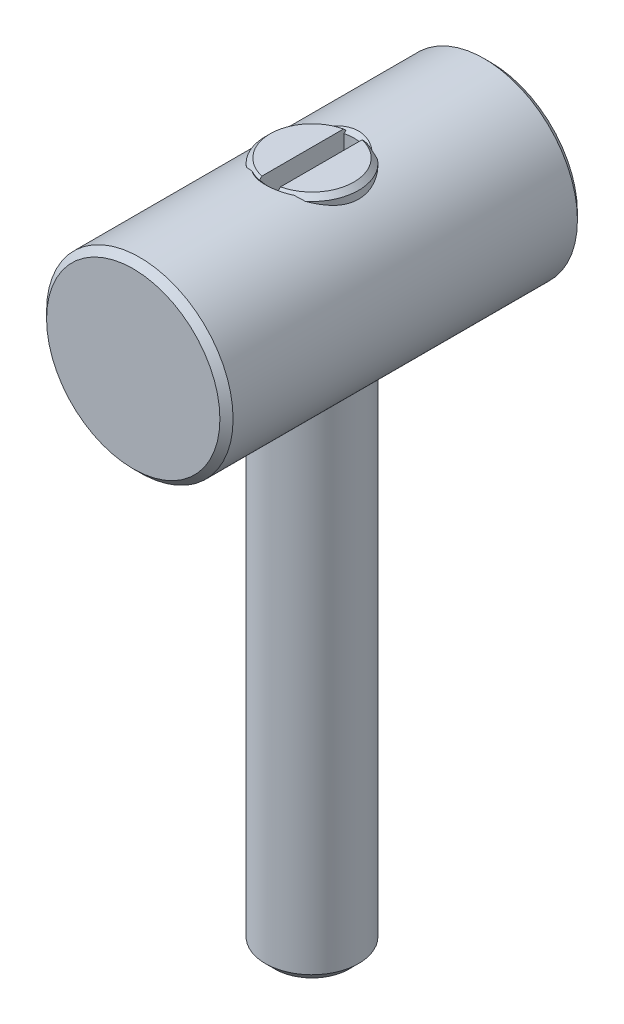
ISO-10303-21;
HEADER;
FILE_DESCRIPTION(('STEP AP214'),'2;1');
FILE_NAME('part.step','',(''),(''),'','','');
FILE_SCHEMA(('AUTOMOTIVE_DESIGN { 1 0 10303 214 1 1 1 1 }'));
ENDSEC;
DATA;
#1=APPLICATION_CONTEXT('core data for automotive mechanical design processes');
#2=APPLICATION_PROTOCOL_DEFINITION('international standard','automotive_design',2000,#1);
#3=PRODUCT_CONTEXT('',#1,'mechanical');
#4=PRODUCT('Part','Part','',(#3));
#5=PRODUCT_RELATED_PRODUCT_CATEGORY('part','',(#4));
#6=PRODUCT_DEFINITION_FORMATION('','',#4);
#7=PRODUCT_DEFINITION_CONTEXT('part definition',#1,'design');
#8=PRODUCT_DEFINITION('design','',#6,#7);
#9=PRODUCT_DEFINITION_SHAPE('','',#8);
#10=(LENGTH_UNIT() NAMED_UNIT(*) SI_UNIT(.MILLI.,.METRE.));
#11=(NAMED_UNIT(*) PLANE_ANGLE_UNIT() SI_UNIT($,.RADIAN.));
#12=(NAMED_UNIT(*) SI_UNIT($,.STERADIAN.) SOLID_ANGLE_UNIT());
#13=UNCERTAINTY_MEASURE_WITH_UNIT(LENGTH_MEASURE(1.E-05),#10,'distance_accuracy_value','');
#14=(GEOMETRIC_REPRESENTATION_CONTEXT(3) GLOBAL_UNCERTAINTY_ASSIGNED_CONTEXT((#13)) GLOBAL_UNIT_ASSIGNED_CONTEXT((#10,
#11,#12)) REPRESENTATION_CONTEXT('',''));
#15=CARTESIAN_POINT('',(0.,0.,0.));
#16=DIRECTION('',(0.,0.,1.));
#17=DIRECTION('',(1.,0.,0.));
#18=AXIS2_PLACEMENT_3D('',#15,#16,#17);
#19=CARTESIAN_POINT('',(0.,-4.,0.));
#20=DIRECTION('',(0.,-1.,0.));
#21=DIRECTION('',(-1.,0.,0.));
#22=AXIS2_PLACEMENT_3D('',#19,#20,#21);
#23=CYLINDRICAL_SURFACE('',#22,1.5);
#24=CARTESIAN_POINT('',(0.947331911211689,2.8465,-1.16299709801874));
#25=CARTESIAN_POINT('',(1.01351143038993,2.82450537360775,-1.10908406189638));
#26=CARTESIAN_POINT('',(1.07489527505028,2.80147999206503,-1.04969000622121));
#27=CARTESIAN_POINT('',(1.18710041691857,2.75580128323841,-0.920938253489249));
#28=CARTESIAN_POINT('',(1.2378650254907,2.73315051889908,-0.851530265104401));
#29=CARTESIAN_POINT('',(1.32722551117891,2.69089876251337,-0.704204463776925));
#30=CARTESIAN_POINT('',(1.36579908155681,2.67130339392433,-0.626271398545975));
#31=CARTESIAN_POINT('',(1.42909401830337,2.63798775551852,-0.46394540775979));
#32=CARTESIAN_POINT('',(1.45385048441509,2.62425262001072,-0.379569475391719));
#33=CARTESIAN_POINT('',(1.48697739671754,2.60561664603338,-0.213368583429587));
#34=CARTESIAN_POINT('',(1.49644089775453,2.60012870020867,-0.131829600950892));
#35=CARTESIAN_POINT('',(1.5018928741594,2.59698536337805,0.0318566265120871));
#36=CARTESIAN_POINT('',(1.49788424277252,2.59932829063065,0.114003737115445));
#37=CARTESIAN_POINT('',(1.47773438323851,2.61082510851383,0.267779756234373));
#38=CARTESIAN_POINT('',(1.4628558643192,2.61926920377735,0.339634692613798));
#39=CARTESIAN_POINT('',(1.42308110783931,2.64108893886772,0.47973567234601));
#40=CARTESIAN_POINT('',(1.39818007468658,2.65446693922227,0.547979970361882));
#41=CARTESIAN_POINT('',(1.33746138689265,2.68559571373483,0.683395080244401));
#42=CARTESIAN_POINT('',(1.30108662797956,2.70355780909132,0.750265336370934));
#43=CARTESIAN_POINT('',(1.21901847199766,2.74153817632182,0.877331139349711));
#44=CARTESIAN_POINT('',(1.17332890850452,2.76155560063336,0.93752941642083));
#45=CARTESIAN_POINT('',(1.09644538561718,2.79260769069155,1.02443697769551));
#46=CARTESIAN_POINT('',(1.06820925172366,2.80355315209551,1.05384666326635));
#47=CARTESIAN_POINT('',(1.00945808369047,2.82523876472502,1.11024632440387));
#48=CARTESIAN_POINT('',(0.978947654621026,2.83597927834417,1.13724095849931));
#49=CARTESIAN_POINT('',(0.947331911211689,2.8465,1.16299709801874));
#50=B_SPLINE_CURVE_WITH_KNOTS('',3,(#24,#25,#26,#27,#28,#29,#30,#31,#32,#33,#34,#35,#36,#37,#38,
#39,#40,#41,#42,#43,#44,#45,#46,#47,#48,#49),.UNSPECIFIED.,.F.,.F.,(4,2,2,2,2,2,2,2,2,2,2,2,4),
(0.,0.264174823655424,0.529725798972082,0.79575989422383,1.06111506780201,1.30649824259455,
1.55182872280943,1.77244859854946,1.99317416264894,2.22691434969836,2.46055853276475,
2.58708455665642,2.71336100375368),.UNSPECIFIED.);
#51=CARTESIAN_POINT('',(0.947331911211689,2.8465,-1.16299709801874));
#52=VERTEX_POINT('',#51);
#53=CARTESIAN_POINT('',(0.947331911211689,2.8465,1.16299709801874));
#54=VERTEX_POINT('',#53);
#55=EDGE_CURVE('E221',#52,#54,#50,.T.);
#56=ORIENTED_EDGE('',*,*,#55,.F.);
#57=CARTESIAN_POINT('',(0.,2.8465,0.));
#58=DIRECTION('',(0.,-1.,0.));
#59=DIRECTION('',(-1.,0.,0.));
#60=AXIS2_PLACEMENT_3D('',#57,#58,#59);
#61=CIRCLE('',#60,1.5);
#62=EDGE_CURVE('E125',#52,#54,#61,.T.);
#63=ORIENTED_EDGE('',*,*,#62,.T.);
#64=EDGE_LOOP('',(#56,#63));
#65=FACE_BOUND('',#64,.T.);
#66=ADVANCED_FACE('F14',(#65),#23,.T.);
#67=CARTESIAN_POINT('',(0.,3.,0.));
#68=DIRECTION('',(0.,-1.,0.));
#69=DIRECTION('',(-1.,0.,0.));
#70=AXIS2_PLACEMENT_3D('',#67,#68,#69);
#71=PLANE('',#70);
#72=DIRECTION('',(0.,0.,1.));
#73=VECTOR('',#72,1.);
#74=CARTESIAN_POINT('',(-0.3,3.,0.));
#75=LINE('',#74,#73);
#76=CARTESIAN_POINT('',(-0.3,3.,-1.31265465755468));
#77=VERTEX_POINT('',#76);
#78=CARTESIAN_POINT('',(-0.3,3.,1.31265465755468));
#79=VERTEX_POINT('',#78);
#80=EDGE_CURVE('E110',#77,#79,#75,.T.);
#81=ORIENTED_EDGE('',*,*,#80,.F.);
#82=CARTESIAN_POINT('',(0.,3.,0.));
#83=DIRECTION('',(0.,-1.,0.));
#84=DIRECTION('',(-1.,0.,0.));
#85=AXIS2_PLACEMENT_3D('',#82,#83,#84);
#86=CIRCLE('',#85,1.3465);
#87=EDGE_CURVE('E121',#79,#77,#86,.T.);
#88=ORIENTED_EDGE('',*,*,#87,.F.);
#89=EDGE_LOOP('',(#81,#88));
#90=FACE_BOUND('',#89,.T.);
#91=ADVANCED_FACE('F120',(#90),#71,.F.);
#92=CARTESIAN_POINT('',(0.,3.,0.));
#93=DIRECTION('',(0.,-1.,0.));
#94=DIRECTION('',(-1.,0.,0.));
#95=AXIS2_PLACEMENT_3D('',#92,#93,#94);
#96=CONICAL_SURFACE('',#95,1.3465,0.785398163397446);
#97=CARTESIAN_POINT('',(-0.992835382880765,2.83095,-1.14506318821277));
#98=CARTESIAN_POINT('',(-0.929590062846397,2.85313590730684,-1.17057691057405));
#99=CARTESIAN_POINT('',(-0.864893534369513,2.87343844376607,-1.19430901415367));
#100=CARTESIAN_POINT('',(-0.733580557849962,2.90971649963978,-1.23716783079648));
#101=CARTESIAN_POINT('',(-0.666989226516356,2.92573258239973,-1.25633751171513));
#102=CARTESIAN_POINT('',(-0.531496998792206,2.95335159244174,-1.28959120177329));
#103=CARTESIAN_POINT('',(-0.46259234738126,2.96494692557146,-1.30366645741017));
#104=CARTESIAN_POINT('',(-0.322550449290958,2.98346059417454,-1.32622709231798));
#105=CARTESIAN_POINT('',(-0.251397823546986,2.99033132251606,-1.33465555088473));
#106=CARTESIAN_POINT('',(-0.1798,2.99460714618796,-1.33988292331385));
#107=B_SPLINE_CURVE_WITH_KNOTS('',3,(#97,#98,#99,#100,#101,#102,#103,#104,#105,#106),
.UNSPECIFIED.,.F.,.F.,(4,2,2,2,4),(0.,0.215180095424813,0.428245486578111,0.64167525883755,
0.85722531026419),.UNSPECIFIED.);
#108=CARTESIAN_POINT('',(-0.947331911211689,2.8465,-1.16299709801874));
#109=VERTEX_POINT('',#108);
#110=CARTESIAN_POINT('',(-0.674247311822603,2.92325,-1.25340780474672));
#111=VERTEX_POINT('',#110);
#112=EDGE_CURVE('E9',#109,#111,#107,.T.);
#113=ORIENTED_EDGE('',*,*,#112,.F.);
#114=CARTESIAN_POINT('',(-0.947331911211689,2.8465,1.16299709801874));
#115=VERTEX_POINT('',#114);
#116=EDGE_CURVE('E130',#115,#109,#61,.T.);
#117=ORIENTED_EDGE('',*,*,#116,.F.);
#118=CARTESIAN_POINT('',(-0.1798,2.99460714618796,1.33988292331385));
#119=CARTESIAN_POINT('',(-0.236038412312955,2.99124022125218,1.335761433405));
#120=CARTESIAN_POINT('',(-0.292017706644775,2.9862800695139,1.3296804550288));
#121=CARTESIAN_POINT('',(-0.403063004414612,2.97332250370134,1.31386344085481));
#122=CARTESIAN_POINT('',(-0.458129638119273,2.96532728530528,1.30413004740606));
#123=CARTESIAN_POINT('',(-0.56626748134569,2.94657689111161,1.28142693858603));
#124=CARTESIAN_POINT('',(-0.619355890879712,2.93586230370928,1.26850488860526));
#125=CARTESIAN_POINT('',(-0.724099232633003,2.91179776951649,1.23969917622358));
#126=CARTESIAN_POINT('',(-0.775754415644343,2.89844828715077,1.22381603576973));
#127=CARTESIAN_POINT('',(-0.854754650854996,2.87580466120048,1.1971455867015));
#128=CARTESIAN_POINT('',(-0.882653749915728,2.86736203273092,1.18725045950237));
#129=CARTESIAN_POINT('',(-0.93806639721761,2.8497157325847,1.16670181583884));
#130=CARTESIAN_POINT('',(-0.96557794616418,2.84050913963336,1.15604541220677));
#131=CARTESIAN_POINT('',(-0.992835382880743,2.83095,1.14506318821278));
#132=B_SPLINE_CURVE_WITH_KNOTS('',3,(#118,#119,#120,#121,#122,#123,#124,#125,#126,#127,#128,
#129,#130,#131),.UNSPECIFIED.,.F.,.F.,(4,2,2,2,2,2,4),(0.,0.169384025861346,0.338645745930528,
0.505516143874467,0.672357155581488,0.764685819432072,0.857385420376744),.UNSPECIFIED.);
#133=CARTESIAN_POINT('',(-0.674247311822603,2.92325,1.25340780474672));
#134=VERTEX_POINT('',#133);
#135=EDGE_CURVE('E40',#134,#115,#132,.T.);
#136=ORIENTED_EDGE('',*,*,#135,.F.);
#137=CARTESIAN_POINT('',(0.,2.92325,0.));
#138=DIRECTION('',(0.,1.,0.));
#139=DIRECTION('',(0.,0.,1.));
#140=AXIS2_PLACEMENT_3D('',#137,#138,#139);
#141=CIRCLE('',#140,1.42325);
#142=CARTESIAN_POINT('',(-0.3,2.92325,1.39127300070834));
#143=VERTEX_POINT('',#142);
#144=EDGE_CURVE('E189',#134,#143,#141,.T.);
#145=ORIENTED_EDGE('',*,*,#144,.T.);
#146=CARTESIAN_POINT('',(-0.3,2.8458,-1.4704082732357));
#147=CARTESIAN_POINT('',(-0.3,2.88115643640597,-1.43432199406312));
#148=CARTESIAN_POINT('',(-0.3,2.91648779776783,-1.39821111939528));
#149=CARTESIAN_POINT('',(-0.3,2.98714018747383,-1.32586601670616));
#150=CARTESIAN_POINT('',(-0.3,3.0224611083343,-1.28963168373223));
#151=CARTESIAN_POINT('',(-0.3,3.09397621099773,-1.21609681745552));
#152=CARTESIAN_POINT('',(-0.3,3.13016808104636,-1.1787940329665));
#153=CARTESIAN_POINT('',(-0.3,3.20237441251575,-1.10413383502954));
#154=CARTESIAN_POINT('',(-0.3,3.23838906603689,-1.06677660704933));
#155=CARTESIAN_POINT('',(-0.3,3.34146505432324,-0.959421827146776));
#156=CARTESIAN_POINT('',(-0.3,3.40833744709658,-0.889241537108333));
#157=CARTESIAN_POINT('',(-0.3,3.50808269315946,-0.78299989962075));
#158=CARTESIAN_POINT('',(-0.3,3.54134564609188,-0.747305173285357));
#159=CARTESIAN_POINT('',(-0.3,3.6074459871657,-0.675572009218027));
#160=CARTESIAN_POINT('',(-0.3,3.64028367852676,-0.639533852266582));
#161=CARTESIAN_POINT('',(-0.3,3.70448937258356,-0.567825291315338));
#162=CARTESIAN_POINT('',(-0.3,3.73587344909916,-0.53216929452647));
#163=CARTESIAN_POINT('',(-0.3,3.79773982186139,-0.459887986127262));
#164=CARTESIAN_POINT('',(-0.3,3.82821923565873,-0.423260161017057));
#165=CARTESIAN_POINT('',(-0.3,3.8723076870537,-0.367400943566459));
#166=CARTESIAN_POINT('',(-0.3,3.88664675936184,-0.348748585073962));
#167=CARTESIAN_POINT('',(-0.3,3.91462683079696,-0.310930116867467));
#168=CARTESIAN_POINT('',(-0.3,3.92826804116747,-0.291764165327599));
#169=CARTESIAN_POINT('',(-0.3,3.95444414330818,-0.252814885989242));
#170=CARTESIAN_POINT('',(-0.3,3.96698388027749,-0.233034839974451));
#171=CARTESIAN_POINT('',(-0.3,3.99041713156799,-0.192530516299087));
#172=CARTESIAN_POINT('',(-0.3,4.00131370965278,-0.171808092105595));
#173=CARTESIAN_POINT('',(-0.3,4.01290967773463,-0.145940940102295));
#174=CARTESIAN_POINT('',(-0.3,4.01488714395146,-0.141366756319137));
#175=CARTESIAN_POINT('',(-0.3,4.01870640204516,-0.132159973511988));
#176=CARTESIAN_POINT('',(-0.3,4.02054813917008,-0.127527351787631));
#177=CARTESIAN_POINT('',(-0.3,4.02584745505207,-0.113544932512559));
#178=CARTESIAN_POINT('',(-0.3,4.02908025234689,-0.104108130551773));
#179=CARTESIAN_POINT('',(-0.3,4.03477287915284,-0.08516895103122));
#180=CARTESIAN_POINT('',(-0.3,4.03724447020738,-0.0756701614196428));
#181=CARTESIAN_POINT('',(-0.3,4.04137161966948,-0.0564948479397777));
#182=CARTESIAN_POINT('',(-0.3,4.04302692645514,-0.0468182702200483));
#183=CARTESIAN_POINT('',(-0.3,4.04664228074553,-0.0172377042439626));
#184=CARTESIAN_POINT('',(-0.3,4.04714068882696,0.00287379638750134));
#185=CARTESIAN_POINT('',(-0.3,4.04412319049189,0.0428030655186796));
#186=CARTESIAN_POINT('',(-0.3,4.0405978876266,0.0626200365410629));
#187=CARTESIAN_POINT('',(-0.3,4.02858082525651,0.108260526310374));
#188=CARTESIAN_POINT('',(-0.3,4.01877038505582,0.133719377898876));
#189=CARTESIAN_POINT('',(-0.3,4.00150485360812,0.170708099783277));
#190=CARTESIAN_POINT('',(-0.3,3.9952966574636,0.182880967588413));
#191=CARTESIAN_POINT('',(-0.3,3.98222681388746,0.206871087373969));
#192=CARTESIAN_POINT('',(-0.3,3.97536538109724,0.218688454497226));
#193=CARTESIAN_POINT('',(-0.3,3.95218871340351,0.256757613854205));
#194=CARTESIAN_POINT('',(-0.3,3.93487575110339,0.282394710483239));
#195=CARTESIAN_POINT('',(-0.3,3.89886611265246,0.332686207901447));
#196=CARTESIAN_POINT('',(-0.3,3.8801680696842,0.357339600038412));
#197=CARTESIAN_POINT('',(-0.3,3.84187863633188,0.40604123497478));
#198=CARTESIAN_POINT('',(-0.3,3.82228508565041,0.430087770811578));
#199=CARTESIAN_POINT('',(-0.3,3.78254416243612,0.477720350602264));
#200=CARTESIAN_POINT('',(-0.3,3.76239671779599,0.501306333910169));
#201=CARTESIAN_POINT('',(-0.3,3.70125985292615,0.571740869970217));
#202=CARTESIAN_POINT('',(-0.3,3.65970988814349,0.618101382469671));
#203=CARTESIAN_POINT('',(-0.3,3.57590945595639,0.710039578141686));
#204=CARTESIAN_POINT('',(-0.3,3.53366022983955,0.75561840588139));
#205=CARTESIAN_POINT('',(-0.3,3.43788259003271,0.857897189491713));
#206=CARTESIAN_POINT('',(-0.3,3.38422190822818,0.914473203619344));
#207=CARTESIAN_POINT('',(-0.3,3.27645519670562,1.02726219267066));
#208=CARTESIAN_POINT('',(-0.3,3.22234892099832,1.08347493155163));
#209=CARTESIAN_POINT('',(-0.3,3.11457978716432,1.19491746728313));
#210=CARTESIAN_POINT('',(-0.3,3.06092031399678,1.25015053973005));
#211=CARTESIAN_POINT('',(-0.3,2.95345728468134,1.36040840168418));
#212=CARTESIAN_POINT('',(-0.3,2.8996538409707,1.41543330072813));
#213=CARTESIAN_POINT('',(-0.3,2.8458,1.4704082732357));
#214=B_SPLINE_CURVE_WITH_KNOTS('',3,(#146,#147,#148,#149,#150,#151,#152,#153,#154,#155,#156,
#157,#158,#159,#160,#161,#162,#163,#164,#165,#166,#167,#168,#169,#170,#171,#172,#173,#174,#175,
#176,#177,#178,#179,#180,#181,#182,#183,#184,#185,#186,#187,#188,#189,#190,#191,#192,#193,#194,
#195,#196,#197,#198,#199,#200,#201,#202,#203,#204,#205,#206,#207,#208,#209,#210,#211,#212,#213),
.UNSPECIFIED.,.F.,.F.,(4,2,2,2,2,2,2,2,2,2,2,2,2,2,2,2,2,2,2,2,2,2,2,2,2,2,2,2,2,2,2,2,2,4),(0.,
0.151560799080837,0.303364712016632,0.459287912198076,0.61495934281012,0.905769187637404,
1.05213984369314,1.19839964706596,1.34089509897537,1.48380422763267,1.5543752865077,
1.62492485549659,1.6951466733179,1.76523589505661,1.78018397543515,1.79513805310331,
1.82503814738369,1.85444992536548,1.88387076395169,1.94377833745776,2.00382609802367,
2.08518752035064,2.12617578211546,2.16715062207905,2.25986253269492,2.35266718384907,
2.44570893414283,2.53876285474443,2.72550711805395,2.91194943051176,3.14587396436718,
3.37993768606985,3.6109572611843,3.84183089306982),.UNSPECIFIED.);
#215=EDGE_CURVE('E117',#79,#143,#214,.T.);
#216=ORIENTED_EDGE('',*,*,#215,.F.);
#217=ORIENTED_EDGE('',*,*,#87,.T.);
#218=CARTESIAN_POINT('',(-0.3,2.92325,-1.39127300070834));
#219=VERTEX_POINT('',#218);
#220=EDGE_CURVE('E106',#219,#77,#214,.T.);
#221=ORIENTED_EDGE('',*,*,#220,.F.);
#222=CARTESIAN_POINT('',(0.,2.92325,0.));
#223=DIRECTION('',(0.,1.,0.));
#224=DIRECTION('',(0.,0.,1.));
#225=AXIS2_PLACEMENT_3D('',#222,#223,#224);
#226=CIRCLE('',#225,1.42325);
#227=EDGE_CURVE('E28',#219,#111,#226,.T.);
#228=ORIENTED_EDGE('',*,*,#227,.T.);
#229=EDGE_LOOP('',(#113,#117,#136,#145,#216,#217,#221,#228));
#230=FACE_BOUND('',#229,.T.);
#231=ADVANCED_FACE('F123',(#230),#96,.T.);
#232=CARTESIAN_POINT('',(0.3,33.3,0.));
#233=DIRECTION('',(-1.,0.,0.));
#234=DIRECTION('',(0.,0.,1.));
#235=AXIS2_PLACEMENT_3D('',#232,#233,#234);
#236=CYLINDRICAL_SURFACE('',#235,31.5);
#237=CARTESIAN_POINT('',(0.3,1.82813733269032,1.33111241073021));
#238=CARTESIAN_POINT('',(0.262266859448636,1.8284977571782,1.33962103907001));
#239=CARTESIAN_POINT('',(0.224170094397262,1.82879235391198,1.34651682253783));
#240=CARTESIAN_POINT('',(0.14752354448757,1.82924457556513,1.35705208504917));
#241=CARTESIAN_POINT('',(0.108973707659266,1.82940218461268,1.36069118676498));
#242=CARTESIAN_POINT('',(0.0324105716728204,1.82957344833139,1.36464401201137));
#243=CARTESIAN_POINT('',(-0.00559964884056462,1.82958968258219,1.3650173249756));
#244=CARTESIAN_POINT('',(-0.0815076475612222,1.82948446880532,1.36259212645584));
#245=CARTESIAN_POINT('',(-0.119405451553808,1.82936305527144,1.35979440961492));
#246=CARTESIAN_POINT('',(-0.205128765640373,1.82893560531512,1.34986012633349));
#247=CARTESIAN_POINT('',(-0.252842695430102,1.8285882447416,1.34174825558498));
#248=CARTESIAN_POINT('',(-0.3,1.82813733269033,1.33111241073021));
#249=B_SPLINE_CURVE_WITH_KNOTS('',3,(#237,#238,#239,#240,#241,#242,#243,#244,#245,#246,#247,
#248),.UNSPECIFIED.,.F.,.F.,(4,2,2,2,2,4),(0.,0.116010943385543,0.232035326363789,
0.345938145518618,0.459812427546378,0.604746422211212),.UNSPECIFIED.);
#250=CARTESIAN_POINT('',(0.3,1.82813733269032,1.33111241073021));
#251=VERTEX_POINT('',#250);
#252=CARTESIAN_POINT('',(-0.3,1.82813733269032,1.33111241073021));
#253=VERTEX_POINT('',#252);
#254=EDGE_CURVE('E293',#251,#253,#249,.T.);
#255=ORIENTED_EDGE('',*,*,#254,.F.);
#256=CARTESIAN_POINT('',(0.3,33.3,0.));
#257=DIRECTION('',(1.,0.,0.));
#258=DIRECTION('',(0.,0.,-1.));
#259=AXIS2_PLACEMENT_3D('',#256,#257,#258);
#260=CIRCLE('',#259,31.5);
#261=CARTESIAN_POINT('',(0.3,1.82813733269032,-1.33111241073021));
#262=VERTEX_POINT('',#261);
#263=EDGE_CURVE('E115',#251,#262,#260,.T.);
#264=ORIENTED_EDGE('',*,*,#263,.T.);
#265=CARTESIAN_POINT('',(-0.3,1.82813733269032,-1.33111241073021));
#266=CARTESIAN_POINT('',(-0.262266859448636,1.8284977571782,-1.33962103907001));
#267=CARTESIAN_POINT('',(-0.224170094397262,1.82879235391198,-1.34651682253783));
#268=CARTESIAN_POINT('',(-0.14752354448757,1.82924457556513,-1.35705208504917));
#269=CARTESIAN_POINT('',(-0.108973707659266,1.82940218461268,-1.36069118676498));
#270=CARTESIAN_POINT('',(-0.0324105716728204,1.82957344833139,-1.36464401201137));
#271=CARTESIAN_POINT('',(0.00559964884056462,1.82958968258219,-1.3650173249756));
#272=CARTESIAN_POINT('',(0.0815076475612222,1.82948446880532,-1.36259212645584));
#273=CARTESIAN_POINT('',(0.119405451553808,1.82936305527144,-1.35979440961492));
#274=CARTESIAN_POINT('',(0.205128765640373,1.82893560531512,-1.34986012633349));
#275=CARTESIAN_POINT('',(0.252842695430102,1.8285882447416,-1.34174825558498));
#276=CARTESIAN_POINT('',(0.3,1.82813733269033,-1.33111241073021));
#277=B_SPLINE_CURVE_WITH_KNOTS('',3,(#265,#266,#267,#268,#269,#270,#271,#272,#273,#274,#275,
#276),.UNSPECIFIED.,.F.,.F.,(4,2,2,2,2,4),(0.,0.116010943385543,0.232035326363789,
0.345938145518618,0.459812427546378,0.604746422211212),.UNSPECIFIED.);
#278=CARTESIAN_POINT('',(-0.3,1.82813733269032,-1.33111241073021));
#279=VERTEX_POINT('',#278);
#280=EDGE_CURVE('E187',#279,#262,#277,.T.);
#281=ORIENTED_EDGE('',*,*,#280,.F.);
#282=CARTESIAN_POINT('',(-0.3,33.3,0.));
#283=DIRECTION('',(1.,0.,0.));
#284=DIRECTION('',(0.,0.,-1.));
#285=AXIS2_PLACEMENT_3D('',#282,#283,#284);
#286=CIRCLE('',#285,31.5);
#287=EDGE_CURVE('E282',#253,#279,#286,.T.);
#288=ORIENTED_EDGE('',*,*,#287,.F.);
#289=EDGE_LOOP('',(#255,#264,#281,#288));
#290=FACE_BOUND('',#289,.T.);
#291=ADVANCED_FACE('F270',(#290),#236,.F.);
#292=CARTESIAN_POINT('',(-0.3,33.3,0.));
#293=DIRECTION('',(1.,0.,0.));
#294=DIRECTION('',(0.,0.,-1.));
#295=AXIS2_PLACEMENT_3D('',#292,#293,#294);
#296=PLANE('',#295);
#297=CARTESIAN_POINT('',(-0.3,2.23530206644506,0.671318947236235));
#298=CARTESIAN_POINT('',(-0.3,2.25951576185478,0.697833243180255));
#299=CARTESIAN_POINT('',(-0.3,2.28385163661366,0.724235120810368));
#300=CARTESIAN_POINT('',(-0.3,2.33271486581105,0.776860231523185));
#301=CARTESIAN_POINT('',(-0.3,2.35724221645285,0.803083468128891));
#302=CARTESIAN_POINT('',(-0.3,2.43103122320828,0.881553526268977));
#303=CARTESIAN_POINT('',(-0.3,2.48050219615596,0.933603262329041));
#304=CARTESIAN_POINT('',(-0.3,2.57977835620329,1.03737516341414));
#305=CARTESIAN_POINT('',(-0.3,2.62958351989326,1.08909735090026));
#306=CARTESIAN_POINT('',(-0.3,2.72941861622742,1.19232568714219));
#307=CARTESIAN_POINT('',(-0.3,2.77944855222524,1.24383183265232));
#308=CARTESIAN_POINT('',(-0.3,2.94833708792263,1.41719880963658));
#309=CARTESIAN_POINT('',(-0.3,3.06754094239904,1.53872304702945));
#310=CARTESIAN_POINT('',(-0.3,3.24664716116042,1.72072148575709));
#311=CARTESIAN_POINT('',(-0.3,3.30640150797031,1.78134186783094));
#312=CARTESIAN_POINT('',(-0.3,3.42598789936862,1.9025053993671));
#313=CARTESIAN_POINT('',(-0.3,3.4858199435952,1.9630485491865));
#314=CARTESIAN_POINT('',(-0.3,3.54568061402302,2.02356348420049));
#315=B_SPLINE_CURVE_WITH_KNOTS('',3,(#297,#298,#299,#300,#301,#302,#303,#304,#305,#306,#307,
#308,#309,#310,#311,#312,#313,#314),.UNSPECIFIED.,.F.,.F.,(4,2,2,2,2,2,2,2,4),(0.,
0.107719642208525,0.215437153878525,0.430861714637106,0.646271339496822,0.861684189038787,
1.37236666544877,1.62772666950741,1.88308548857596),.UNSPECIFIED.);
#316=CARTESIAN_POINT('',(-0.3,2.8645,1.33111241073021));
#317=VERTEX_POINT('',#316);
#318=EDGE_CURVE('E173',#317,#143,#315,.T.);
#319=ORIENTED_EDGE('',*,*,#318,.F.);
#320=DIRECTION('',(0.,-1.,0.));
#321=VECTOR('',#320,1.);
#322=CARTESIAN_POINT('',(-0.3,-3.,1.33111241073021));
#323=LINE('',#322,#321);
#324=EDGE_CURVE('E142',#253,#317,#323,.F.);
#325=ORIENTED_EDGE('',*,*,#324,.F.);
#326=ORIENTED_EDGE('',*,*,#287,.T.);
#327=DIRECTION('',(0.,-1.,0.));
#328=VECTOR('',#327,1.);
#329=CARTESIAN_POINT('',(-0.3,-3.,-1.33111241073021));
#330=LINE('',#329,#328);
#331=CARTESIAN_POINT('',(-0.3,2.8645,-1.33111241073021));
#332=VERTEX_POINT('',#331);
#333=EDGE_CURVE('E128',#332,#279,#330,.T.);
#334=ORIENTED_EDGE('',*,*,#333,.F.);
#335=CARTESIAN_POINT('',(-0.3,3.54348929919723,-2.02134819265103));
#336=CARTESIAN_POINT('',(-0.3,3.48857377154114,-1.96583089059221));
#337=CARTESIAN_POINT('',(-0.3,3.43368230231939,-1.91028984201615));
#338=CARTESIAN_POINT('',(-0.3,3.32396337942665,-1.79914422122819));
#339=CARTESIAN_POINT('',(-0.3,3.26913592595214,-1.74353964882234));
#340=CARTESIAN_POINT('',(-0.3,3.10478055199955,-1.57661382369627));
#341=CARTESIAN_POINT('',(-0.3,2.99537298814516,-1.46517376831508));
#342=CARTESIAN_POINT('',(-0.3,2.83172644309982,-1.29755058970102));
#343=CARTESIAN_POINT('',(-0.3,2.77725282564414,-1.241596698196));
#344=CARTESIAN_POINT('',(-0.3,2.66854234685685,-1.1294608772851));
#345=CARTESIAN_POINT('',(-0.3,2.6143054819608,-1.07327895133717));
#346=CARTESIAN_POINT('',(-0.3,2.506191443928,-0.960561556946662));
#347=CARTESIAN_POINT('',(-0.3,2.45231429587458,-0.904026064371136));
#348=CARTESIAN_POINT('',(-0.3,2.37196128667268,-0.81878330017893));
#349=CARTESIAN_POINT('',(-0.3,2.34525340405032,-0.790295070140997));
#350=CARTESIAN_POINT('',(-0.3,2.29205508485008,-0.733115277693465));
#351=CARTESIAN_POINT('',(-0.3,2.26556465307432,-0.70442371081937));
#352=CARTESIAN_POINT('',(-0.3,2.23921490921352,-0.675602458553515));
#353=B_SPLINE_CURVE_WITH_KNOTS('',3,(#335,#336,#337,#338,#339,#340,#341,#342,#343,#344,#345,
#346,#347,#348,#349,#350,#351,#352),.UNSPECIFIED.,.F.,.F.,(4,2,2,2,2,2,2,2,4),(0.,
0.234266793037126,0.468534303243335,0.937041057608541,1.17131374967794,1.40558290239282,
1.63986822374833,1.75701676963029,1.87416789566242),.UNSPECIFIED.);
#354=EDGE_CURVE('E113',#219,#332,#353,.T.);
#355=ORIENTED_EDGE('',*,*,#354,.F.);
#356=ORIENTED_EDGE('',*,*,#220,.T.);
#357=ORIENTED_EDGE('',*,*,#80,.T.);
#358=ORIENTED_EDGE('',*,*,#215,.T.);
#359=EDGE_LOOP('',(#319,#325,#326,#334,#355,#356,#357,#358));
#360=FACE_BOUND('',#359,.T.);
#361=ADVANCED_FACE('F108',(#360),#296,.T.);
#362=CARTESIAN_POINT('',(0.3,3.,-1.31265465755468));
#363=VERTEX_POINT('',#362);
#364=CARTESIAN_POINT('',(0.3,3.,1.31265465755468));
#365=VERTEX_POINT('',#364);
#366=EDGE_CURVE('E124',#363,#365,#86,.T.);
#367=ORIENTED_EDGE('',*,*,#366,.F.);
#368=DIRECTION('',(0.,0.,1.));
#369=VECTOR('',#368,1.);
#370=CARTESIAN_POINT('',(0.3,3.,0.));
#371=LINE('',#370,#369);
#372=EDGE_CURVE('E358',#363,#365,#371,.T.);
#373=ORIENTED_EDGE('',*,*,#372,.T.);
#374=EDGE_LOOP('',(#367,#373));
#375=FACE_BOUND('',#374,.T.);
#376=ADVANCED_FACE('F271',(#375),#71,.F.);
#377=CARTESIAN_POINT('',(0.1798,2.99460714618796,-1.33988292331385));
#378=CARTESIAN_POINT('',(0.236038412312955,2.99124022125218,-1.335761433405));
#379=CARTESIAN_POINT('',(0.292017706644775,2.9862800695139,-1.3296804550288));
#380=CARTESIAN_POINT('',(0.403063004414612,2.97332250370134,-1.31386344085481));
#381=CARTESIAN_POINT('',(0.458129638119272,2.96532728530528,-1.30413004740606));
#382=CARTESIAN_POINT('',(0.566267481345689,2.94657689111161,-1.28142693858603));
#383=CARTESIAN_POINT('',(0.619355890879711,2.93586230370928,-1.26850488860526));
#384=CARTESIAN_POINT('',(0.724099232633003,2.91179776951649,-1.23969917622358));
#385=CARTESIAN_POINT('',(0.775754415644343,2.89844828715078,-1.22381603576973));
#386=CARTESIAN_POINT('',(0.854754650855,2.87580466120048,-1.1971455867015));
#387=CARTESIAN_POINT('',(0.882653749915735,2.86736203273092,-1.18725045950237));
#388=CARTESIAN_POINT('',(0.938066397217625,2.8497157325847,-1.16670181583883));
#389=CARTESIAN_POINT('',(0.965577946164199,2.84050913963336,-1.15604541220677));
#390=CARTESIAN_POINT('',(0.992835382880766,2.83095,-1.14506318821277));
#391=B_SPLINE_CURVE_WITH_KNOTS('',3,(#377,#378,#379,#380,#381,#382,#383,#384,#385,#386,#387,
#388,#389,#390),.UNSPECIFIED.,.F.,.F.,(4,2,2,2,2,2,4),(0.,0.169384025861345,0.338645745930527,
0.505516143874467,0.672357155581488,0.764685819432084,0.857385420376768),.UNSPECIFIED.);
#392=CARTESIAN_POINT('',(0.674247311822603,2.92325,-1.25340780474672));
#393=VERTEX_POINT('',#392);
#394=EDGE_CURVE('E219',#393,#52,#391,.T.);
#395=ORIENTED_EDGE('',*,*,#394,.F.);
#396=CARTESIAN_POINT('',(0.,2.92325,0.));
#397=DIRECTION('',(0.,1.,0.));
#398=DIRECTION('',(0.,0.,1.));
#399=AXIS2_PLACEMENT_3D('',#396,#397,#398);
#400=CIRCLE('',#399,1.42325);
#401=CARTESIAN_POINT('',(0.3,2.92325,-1.39127300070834));
#402=VERTEX_POINT('',#401);
#403=EDGE_CURVE('E216',#393,#402,#400,.T.);
#404=ORIENTED_EDGE('',*,*,#403,.T.);
#405=CARTESIAN_POINT('',(0.3,2.8458,-1.4704082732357));
#406=CARTESIAN_POINT('',(0.3,2.88115643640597,-1.43432199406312));
#407=CARTESIAN_POINT('',(0.3,2.91648779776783,-1.39821111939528));
#408=CARTESIAN_POINT('',(0.3,2.98714018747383,-1.32586601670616));
#409=CARTESIAN_POINT('',(0.3,3.0224611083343,-1.28963168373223));
#410=CARTESIAN_POINT('',(0.3,3.09397621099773,-1.21609681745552));
#411=CARTESIAN_POINT('',(0.3,3.13016808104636,-1.1787940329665));
#412=CARTESIAN_POINT('',(0.3,3.20237441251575,-1.10413383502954));
#413=CARTESIAN_POINT('',(0.3,3.23838906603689,-1.06677660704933));
#414=CARTESIAN_POINT('',(0.3,3.34146505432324,-0.959421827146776));
#415=CARTESIAN_POINT('',(0.3,3.40833744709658,-0.889241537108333));
#416=CARTESIAN_POINT('',(0.3,3.50808269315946,-0.78299989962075));
#417=CARTESIAN_POINT('',(0.3,3.54134564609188,-0.747305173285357));
#418=CARTESIAN_POINT('',(0.3,3.6074459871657,-0.675572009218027));
#419=CARTESIAN_POINT('',(0.3,3.64028367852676,-0.639533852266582));
#420=CARTESIAN_POINT('',(0.3,3.70448937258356,-0.567825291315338));
#421=CARTESIAN_POINT('',(0.3,3.73587344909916,-0.53216929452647));
#422=CARTESIAN_POINT('',(0.3,3.79773982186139,-0.459887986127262));
#423=CARTESIAN_POINT('',(0.3,3.82821923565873,-0.423260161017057));
#424=CARTESIAN_POINT('',(0.3,3.8723076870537,-0.367400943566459));
#425=CARTESIAN_POINT('',(0.3,3.88664675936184,-0.348748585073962));
#426=CARTESIAN_POINT('',(0.3,3.91462683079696,-0.310930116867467));
#427=CARTESIAN_POINT('',(0.3,3.92826804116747,-0.291764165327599));
#428=CARTESIAN_POINT('',(0.3,3.95444414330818,-0.252814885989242));
#429=CARTESIAN_POINT('',(0.3,3.96698388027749,-0.233034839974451));
#430=CARTESIAN_POINT('',(0.3,3.99041713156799,-0.192530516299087));
#431=CARTESIAN_POINT('',(0.3,4.00131370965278,-0.171808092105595));
#432=CARTESIAN_POINT('',(0.3,4.01290967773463,-0.145940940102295));
#433=CARTESIAN_POINT('',(0.3,4.01488714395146,-0.141366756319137));
#434=CARTESIAN_POINT('',(0.3,4.01870640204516,-0.132159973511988));
#435=CARTESIAN_POINT('',(0.3,4.02054813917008,-0.127527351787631));
#436=CARTESIAN_POINT('',(0.3,4.02584745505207,-0.113544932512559));
#437=CARTESIAN_POINT('',(0.3,4.02908025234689,-0.104108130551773));
#438=CARTESIAN_POINT('',(0.3,4.03477287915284,-0.08516895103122));
#439=CARTESIAN_POINT('',(0.3,4.03724447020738,-0.0756701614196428));
#440=CARTESIAN_POINT('',(0.3,4.04137161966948,-0.0564948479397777));
#441=CARTESIAN_POINT('',(0.3,4.04302692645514,-0.0468182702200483));
#442=CARTESIAN_POINT('',(0.3,4.04664228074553,-0.0172377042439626));
#443=CARTESIAN_POINT('',(0.3,4.04714068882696,0.00287379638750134));
#444=CARTESIAN_POINT('',(0.3,4.04412319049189,0.0428030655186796));
#445=CARTESIAN_POINT('',(0.3,4.0405978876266,0.0626200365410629));
#446=CARTESIAN_POINT('',(0.3,4.02858082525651,0.108260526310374));
#447=CARTESIAN_POINT('',(0.3,4.01877038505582,0.133719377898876));
#448=CARTESIAN_POINT('',(0.3,4.00150485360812,0.170708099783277));
#449=CARTESIAN_POINT('',(0.3,3.9952966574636,0.182880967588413));
#450=CARTESIAN_POINT('',(0.3,3.98222681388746,0.206871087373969));
#451=CARTESIAN_POINT('',(0.3,3.97536538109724,0.218688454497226));
#452=CARTESIAN_POINT('',(0.3,3.95218871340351,0.256757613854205));
#453=CARTESIAN_POINT('',(0.3,3.93487575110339,0.282394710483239));
#454=CARTESIAN_POINT('',(0.3,3.89886611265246,0.332686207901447));
#455=CARTESIAN_POINT('',(0.3,3.8801680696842,0.357339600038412));
#456=CARTESIAN_POINT('',(0.3,3.84187863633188,0.40604123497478));
#457=CARTESIAN_POINT('',(0.3,3.82228508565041,0.430087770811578));
#458=CARTESIAN_POINT('',(0.3,3.78254416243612,0.477720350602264));
#459=CARTESIAN_POINT('',(0.3,3.76239671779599,0.501306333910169));
#460=CARTESIAN_POINT('',(0.3,3.70125985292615,0.571740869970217));
#461=CARTESIAN_POINT('',(0.3,3.65970988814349,0.618101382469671));
#462=CARTESIAN_POINT('',(0.3,3.57590945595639,0.710039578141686));
#463=CARTESIAN_POINT('',(0.3,3.53366022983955,0.75561840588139));
#464=CARTESIAN_POINT('',(0.3,3.43788259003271,0.857897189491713));
#465=CARTESIAN_POINT('',(0.3,3.38422190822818,0.914473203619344));
#466=CARTESIAN_POINT('',(0.3,3.27645519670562,1.02726219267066));
#467=CARTESIAN_POINT('',(0.3,3.22234892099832,1.08347493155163));
#468=CARTESIAN_POINT('',(0.3,3.11457978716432,1.19491746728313));
#469=CARTESIAN_POINT('',(0.3,3.06092031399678,1.25015053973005));
#470=CARTESIAN_POINT('',(0.3,2.95345728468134,1.36040840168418));
#471=CARTESIAN_POINT('',(0.3,2.8996538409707,1.41543330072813));
#472=CARTESIAN_POINT('',(0.3,2.8458,1.4704082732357));
#473=B_SPLINE_CURVE_WITH_KNOTS('',3,(#405,#406,#407,#408,#409,#410,#411,#412,#413,#414,#415,
#416,#417,#418,#419,#420,#421,#422,#423,#424,#425,#426,#427,#428,#429,#430,#431,#432,#433,#434,
#435,#436,#437,#438,#439,#440,#441,#442,#443,#444,#445,#446,#447,#448,#449,#450,#451,#452,#453,
#454,#455,#456,#457,#458,#459,#460,#461,#462,#463,#464,#465,#466,#467,#468,#469,#470,#471,#472),
.UNSPECIFIED.,.F.,.F.,(4,2,2,2,2,2,2,2,2,2,2,2,2,2,2,2,2,2,2,2,2,2,2,2,2,2,2,2,2,2,2,2,2,4),(0.,
0.151560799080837,0.303364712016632,0.459287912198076,0.61495934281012,0.905769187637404,
1.05213984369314,1.19839964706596,1.34089509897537,1.48380422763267,1.5543752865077,
1.62492485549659,1.6951466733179,1.76523589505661,1.78018397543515,1.79513805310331,
1.82503814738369,1.85444992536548,1.88387076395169,1.94377833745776,2.00382609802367,
2.08518752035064,2.12617578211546,2.16715062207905,2.25986253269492,2.35266718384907,
2.44570893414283,2.53876285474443,2.72550711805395,2.91194943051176,3.14587396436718,
3.37993768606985,3.6109572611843,3.84183089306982),.UNSPECIFIED.);
#474=EDGE_CURVE('E202',#402,#363,#473,.T.);
#475=ORIENTED_EDGE('',*,*,#474,.T.);
#476=ORIENTED_EDGE('',*,*,#366,.T.);
#477=CARTESIAN_POINT('',(0.3,2.92325,1.39127300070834));
#478=VERTEX_POINT('',#477);
#479=EDGE_CURVE('E359',#365,#478,#473,.T.);
#480=ORIENTED_EDGE('',*,*,#479,.T.);
#481=CARTESIAN_POINT('',(0.,2.92325,0.));
#482=DIRECTION('',(0.,1.,0.));
#483=DIRECTION('',(0.,0.,1.));
#484=AXIS2_PLACEMENT_3D('',#481,#482,#483);
#485=CIRCLE('',#484,1.42325);
#486=CARTESIAN_POINT('',(0.674247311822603,2.92325,1.25340780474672));
#487=VERTEX_POINT('',#486);
#488=EDGE_CURVE('E191',#478,#487,#485,.T.);
#489=ORIENTED_EDGE('',*,*,#488,.T.);
#490=CARTESIAN_POINT('',(0.992835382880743,2.83095,1.14506318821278));
#491=CARTESIAN_POINT('',(0.929590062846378,2.85313590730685,1.17057691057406));
#492=CARTESIAN_POINT('',(0.864893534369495,2.87343844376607,1.19430901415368));
#493=CARTESIAN_POINT('',(0.733580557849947,2.90971649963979,1.23716783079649));
#494=CARTESIAN_POINT('',(0.666989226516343,2.92573258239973,1.25633751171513));
#495=CARTESIAN_POINT('',(0.531496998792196,2.95335159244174,1.28959120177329));
#496=CARTESIAN_POINT('',(0.462592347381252,2.96494692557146,1.30366645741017));
#497=CARTESIAN_POINT('',(0.322550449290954,2.98346059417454,1.32622709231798));
#498=CARTESIAN_POINT('',(0.251397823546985,2.99033132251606,1.33465555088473));
#499=CARTESIAN_POINT('',(0.1798,2.99460714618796,1.33988292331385));
#500=B_SPLINE_CURVE_WITH_KNOTS('',3,(#490,#491,#492,#493,#494,#495,#496,#497,#498,#499),
.UNSPECIFIED.,.F.,.F.,(4,2,2,2,4),(0.,0.215180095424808,0.428245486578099,0.641675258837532,
0.857225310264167),.UNSPECIFIED.);
#501=EDGE_CURVE('E220',#54,#487,#500,.T.);
#502=ORIENTED_EDGE('',*,*,#501,.F.);
#503=ORIENTED_EDGE('',*,*,#62,.F.);
#504=EDGE_LOOP('',(#395,#404,#475,#476,#480,#489,#502,#503));
#505=FACE_BOUND('',#504,.T.);
#506=ADVANCED_FACE('F197',(#505),#96,.T.);
#507=CARTESIAN_POINT('',(0.3,33.3,0.));
#508=DIRECTION('',(1.,0.,0.));
#509=DIRECTION('',(0.,0.,-1.));
#510=AXIS2_PLACEMENT_3D('',#507,#508,#509);
#511=PLANE('',#510);
#512=DIRECTION('',(0.,-1.,0.));
#513=VECTOR('',#512,1.);
#514=CARTESIAN_POINT('',(0.3,-3.,1.33111241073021));
#515=LINE('',#514,#513);
#516=CARTESIAN_POINT('',(0.3,2.8645,1.33111241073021));
#517=VERTEX_POINT('',#516);
#518=EDGE_CURVE('E188',#251,#517,#515,.F.);
#519=ORIENTED_EDGE('',*,*,#518,.T.);
#520=CARTESIAN_POINT('',(0.3,2.23530206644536,0.671318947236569));
#521=CARTESIAN_POINT('',(0.3,2.25951576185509,0.697833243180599));
#522=CARTESIAN_POINT('',(0.3,2.28385163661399,0.724235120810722));
#523=CARTESIAN_POINT('',(0.3,2.3327148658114,0.776860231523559));
#524=CARTESIAN_POINT('',(0.3,2.35724221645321,0.803083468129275));
#525=CARTESIAN_POINT('',(0.3,2.43103122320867,0.881553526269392));
#526=CARTESIAN_POINT('',(0.3,2.48050219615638,0.933603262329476));
#527=CARTESIAN_POINT('',(0.3,2.57977835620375,1.03737516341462));
#528=CARTESIAN_POINT('',(0.3,2.62958351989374,1.08909735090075));
#529=CARTESIAN_POINT('',(0.3,2.72941861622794,1.19232568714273));
#530=CARTESIAN_POINT('',(0.3,2.77944855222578,1.24383183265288));
#531=CARTESIAN_POINT('',(0.3,2.94833708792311,1.41719880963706));
#532=CARTESIAN_POINT('',(0.3,3.06754094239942,1.53872304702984));
#533=CARTESIAN_POINT('',(0.3,3.24664716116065,1.72072148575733));
#534=CARTESIAN_POINT('',(0.3,3.3064015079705,1.78134186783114));
#535=CARTESIAN_POINT('',(0.3,3.42598789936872,1.9025053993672));
#536=CARTESIAN_POINT('',(0.3,3.48581994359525,1.96304854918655));
#537=CARTESIAN_POINT('',(0.3,3.54568061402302,2.02356348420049));
#538=B_SPLINE_CURVE_WITH_KNOTS('',3,(#520,#521,#522,#523,#524,#525,#526,#527,#528,#529,#530,
#531,#532,#533,#534,#535,#536,#537),.UNSPECIFIED.,.F.,.F.,(4,2,2,2,2,2,2,2,4),(0.,
0.107719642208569,0.215437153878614,0.430861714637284,0.646271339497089,0.861684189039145,
1.37236666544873,1.62772666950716,1.88308548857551),.UNSPECIFIED.);
#539=EDGE_CURVE('E180',#517,#478,#538,.T.);
#540=ORIENTED_EDGE('',*,*,#539,.T.);
#541=ORIENTED_EDGE('',*,*,#479,.F.);
#542=ORIENTED_EDGE('',*,*,#372,.F.);
#543=ORIENTED_EDGE('',*,*,#474,.F.);
#544=CARTESIAN_POINT('',(0.3,3.54348929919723,-2.02134819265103));
#545=CARTESIAN_POINT('',(0.3,3.48857377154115,-1.96583089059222));
#546=CARTESIAN_POINT('',(0.3,3.43368230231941,-1.91028984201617));
#547=CARTESIAN_POINT('',(0.3,3.3239633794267,-1.79914422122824));
#548=CARTESIAN_POINT('',(0.3,3.2691359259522,-1.7435396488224));
#549=CARTESIAN_POINT('',(0.3,3.10478055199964,-1.57661382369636));
#550=CARTESIAN_POINT('',(0.3,2.99537298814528,-1.4651737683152));
#551=CARTESIAN_POINT('',(0.3,2.83172644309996,-1.29755058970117));
#552=CARTESIAN_POINT('',(0.3,2.77725282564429,-1.24159669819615));
#553=CARTESIAN_POINT('',(0.3,2.66854234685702,-1.12946087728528));
#554=CARTESIAN_POINT('',(0.3,2.61430548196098,-1.07327895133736));
#555=CARTESIAN_POINT('',(0.3,2.50619144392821,-0.960561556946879));
#556=CARTESIAN_POINT('',(0.3,2.4523142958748,-0.904026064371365));
#557=CARTESIAN_POINT('',(0.3,2.37196128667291,-0.818783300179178));
#558=CARTESIAN_POINT('',(0.3,2.34525340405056,-0.790295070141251));
#559=CARTESIAN_POINT('',(0.3,2.29205508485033,-0.733115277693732));
#560=CARTESIAN_POINT('',(0.3,2.26556465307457,-0.704423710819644));
#561=CARTESIAN_POINT('',(0.3,2.23921490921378,-0.675602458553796));
#562=B_SPLINE_CURVE_WITH_KNOTS('',3,(#544,#545,#546,#547,#548,#549,#550,#551,#552,#553,#554,
#555,#556,#557,#558,#559,#560,#561),.UNSPECIFIED.,.F.,.F.,(4,2,2,2,2,2,2,2,4),(0.,
0.234266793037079,0.46853430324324,0.937041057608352,1.1713137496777,1.40558290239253,
1.639868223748,1.75701676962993,1.87416789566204),.UNSPECIFIED.);
#563=CARTESIAN_POINT('',(0.3,2.8645,-1.33111241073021));
#564=VERTEX_POINT('',#563);
#565=EDGE_CURVE('E208',#402,#564,#562,.T.);
#566=ORIENTED_EDGE('',*,*,#565,.T.);
#567=DIRECTION('',(0.,-1.,0.));
#568=VECTOR('',#567,1.);
#569=CARTESIAN_POINT('',(0.3,-3.,-1.33111241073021));
#570=LINE('',#569,#568);
#571=EDGE_CURVE('E215',#564,#262,#570,.T.);
#572=ORIENTED_EDGE('',*,*,#571,.T.);
#573=ORIENTED_EDGE('',*,*,#263,.F.);
#574=EDGE_LOOP('',(#519,#540,#541,#542,#543,#566,#572,#573));
#575=FACE_BOUND('',#574,.T.);
#576=ADVANCED_FACE('F193',(#575),#511,.F.);
#577=CARTESIAN_POINT('',(-0.947331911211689,2.8465,1.16299709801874));
#578=CARTESIAN_POINT('',(-1.01351143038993,2.82450537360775,1.10908406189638));
#579=CARTESIAN_POINT('',(-1.07489527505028,2.80147999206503,1.04969000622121));
#580=CARTESIAN_POINT('',(-1.18710041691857,2.75580128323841,0.920938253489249));
#581=CARTESIAN_POINT('',(-1.2378650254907,2.73315051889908,0.851530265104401));
#582=CARTESIAN_POINT('',(-1.32722551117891,2.69089876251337,0.704204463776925));
#583=CARTESIAN_POINT('',(-1.36579908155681,2.67130339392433,0.626271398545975));
#584=CARTESIAN_POINT('',(-1.42909401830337,2.63798775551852,0.46394540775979));
#585=CARTESIAN_POINT('',(-1.45385048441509,2.62425262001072,0.379569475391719));
#586=CARTESIAN_POINT('',(-1.48697739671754,2.60561664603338,0.213368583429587));
#587=CARTESIAN_POINT('',(-1.49644089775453,2.60012870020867,0.131829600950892));
#588=CARTESIAN_POINT('',(-1.5018928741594,2.59698536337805,-0.0318566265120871));
#589=CARTESIAN_POINT('',(-1.49788424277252,2.59932829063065,-0.114003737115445));
#590=CARTESIAN_POINT('',(-1.47773438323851,2.61082510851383,-0.267779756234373));
#591=CARTESIAN_POINT('',(-1.4628558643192,2.61926920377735,-0.339634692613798));
#592=CARTESIAN_POINT('',(-1.42308110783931,2.64108893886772,-0.47973567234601));
#593=CARTESIAN_POINT('',(-1.39818007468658,2.65446693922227,-0.547979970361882));
#594=CARTESIAN_POINT('',(-1.33746138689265,2.68559571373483,-0.683395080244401));
#595=CARTESIAN_POINT('',(-1.30108662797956,2.70355780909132,-0.750265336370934));
#596=CARTESIAN_POINT('',(-1.21901847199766,2.74153817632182,-0.877331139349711));
#597=CARTESIAN_POINT('',(-1.17332890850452,2.76155560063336,-0.93752941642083));
#598=CARTESIAN_POINT('',(-1.09644538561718,2.79260769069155,-1.02443697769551));
#599=CARTESIAN_POINT('',(-1.06820925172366,2.80355315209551,-1.05384666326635));
#600=CARTESIAN_POINT('',(-1.00945808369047,2.82523876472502,-1.11024632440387));
#601=CARTESIAN_POINT('',(-0.978947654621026,2.83597927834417,-1.13724095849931));
#602=CARTESIAN_POINT('',(-0.947331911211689,2.8465,-1.16299709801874));
#603=B_SPLINE_CURVE_WITH_KNOTS('',3,(#577,#578,#579,#580,#581,#582,#583,#584,#585,#586,#587,
#588,#589,#590,#591,#592,#593,#594,#595,#596,#597,#598,#599,#600,#601,#602),.UNSPECIFIED.,.F.,
.F.,(4,2,2,2,2,2,2,2,2,2,2,2,4),(0.,0.264174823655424,0.529725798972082,0.79575989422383,
1.06111506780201,1.30649824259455,1.55182872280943,1.77244859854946,1.99317416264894,
2.22691434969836,2.46055853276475,2.58708455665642,2.71336100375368),.UNSPECIFIED.);
#604=EDGE_CURVE('E228',#115,#109,#603,.T.);
#605=ORIENTED_EDGE('',*,*,#604,.F.);
#606=ORIENTED_EDGE('',*,*,#116,.T.);
#607=EDGE_LOOP('',(#605,#606));
#608=FACE_BOUND('',#607,.T.);
#609=ADVANCED_FACE('F196',(#608),#23,.T.);
#610=CARTESIAN_POINT('',(0.,-18.6935,0.));
#611=DIRECTION('',(0.,-1.,0.));
#612=DIRECTION('',(-1.,0.,0.));
#613=AXIS2_PLACEMENT_3D('',#610,#611,#612);
#614=CIRCLE('',#613,1.5);
#615=CARTESIAN_POINT('',(-1.5,-18.6935,0.));
#616=VERTEX_POINT('',#615);
#617=EDGE_CURVE('E366',#616,#616,#614,.T.);
#618=ORIENTED_EDGE('',*,*,#617,.F.);
#619=EDGE_LOOP('',(#618));
#620=FACE_BOUND('',#619,.T.);
#621=CARTESIAN_POINT('',(-1.5,-2.59807621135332,0.));
#622=CARTESIAN_POINT('',(-1.4999945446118,-2.59808302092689,0.0781617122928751));
#623=CARTESIAN_POINT('',(-1.49384995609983,-2.60165701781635,0.156422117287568));
#624=CARTESIAN_POINT('',(-1.46958481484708,-2.61543549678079,0.310540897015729));
#625=CARTESIAN_POINT('',(-1.45143909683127,-2.62565391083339,0.386393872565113));
#626=CARTESIAN_POINT('',(-1.40414992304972,-2.65124019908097,0.533177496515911));
#627=CARTESIAN_POINT('',(-1.3750649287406,-2.66658065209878,0.60413197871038));
#628=CARTESIAN_POINT('',(-1.30690128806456,-2.70063997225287,0.740136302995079));
#629=CARTESIAN_POINT('',(-1.26782210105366,-2.71935902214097,0.805185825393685));
#630=CARTESIAN_POINT('',(-1.17699981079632,-2.75995303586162,0.933458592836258));
#631=CARTESIAN_POINT('',(-1.12447805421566,-2.7819609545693,0.996088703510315));
#632=CARTESIAN_POINT('',(-1.0098807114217,-2.82557974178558,1.11211258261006));
#633=CARTESIAN_POINT('',(-0.94780038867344,-2.84719040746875,1.16550174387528));
#634=CARTESIAN_POINT('',(-0.81073434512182,-2.88932215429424,1.26505072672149));
#635=CARTESIAN_POINT('',(-0.735160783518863,-2.90967159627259,1.31048065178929));
#636=CARTESIAN_POINT('',(-0.576235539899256,-2.94526134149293,1.38771127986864));
#637=CARTESIAN_POINT('',(-0.492888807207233,-2.96050486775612,1.41952058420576));
#638=CARTESIAN_POINT('',(-0.327067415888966,-2.98320691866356,1.46625699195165));
#639=CARTESIAN_POINT('',(-0.244952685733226,-2.99114220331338,1.4822242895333));
#640=CARTESIAN_POINT('',(-0.0788559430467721,-3.00011375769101,1.50024917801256));
#641=CARTESIAN_POINT('',(0.00512490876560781,-3.00115420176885,1.50231518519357));
#642=CARTESIAN_POINT('',(0.164748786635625,-2.99644472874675,1.49287998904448));
#643=CARTESIAN_POINT('',(0.240481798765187,-2.99127743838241,1.48254297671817));
#644=CARTESIAN_POINT('',(0.388970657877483,-2.97561367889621,1.45067873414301));
#645=CARTESIAN_POINT('',(0.461726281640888,-2.96511681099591,1.42915066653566));
#646=CARTESIAN_POINT('',(0.60346408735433,-2.93957374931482,1.37537615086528));
#647=CARTESIAN_POINT('',(0.672380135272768,-2.92446662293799,1.3429855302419));
#648=CARTESIAN_POINT('',(0.803965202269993,-2.89106468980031,1.26860487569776));
#649=CARTESIAN_POINT('',(0.866631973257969,-2.87276874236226,1.22661140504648));
#650=CARTESIAN_POINT('',(0.990260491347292,-2.83266591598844,1.12965697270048));
#651=CARTESIAN_POINT('',(1.05050111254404,-2.81069063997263,1.07384545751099));
#652=CARTESIAN_POINT('',(1.16115655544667,-2.76681510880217,0.953115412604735));
#653=CARTESIAN_POINT('',(1.21156381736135,-2.74491492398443,0.888189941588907));
#654=CARTESIAN_POINT('',(1.30425800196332,-2.70216234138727,0.746027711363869));
#655=CARTESIAN_POINT('',(1.34582597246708,-2.68146479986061,0.668270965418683));
#656=CARTESIAN_POINT('',(1.41497866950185,-2.64563175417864,0.505593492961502));
#657=CARTESIAN_POINT('',(1.44257798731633,-2.63049045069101,0.420680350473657));
#658=CARTESIAN_POINT('',(1.48077031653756,-2.60916953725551,0.253178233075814));
#659=CARTESIAN_POINT('',(1.49253768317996,-2.60237483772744,0.170938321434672));
#660=CARTESIAN_POINT('',(1.50227541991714,-2.59676879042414,0.00539798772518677));
#661=CARTESIAN_POINT('',(1.50025553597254,-2.59795180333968,-0.077901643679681));
#662=CARTESIAN_POINT('',(1.48355406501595,-2.60751504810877,-0.233480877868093));
#663=CARTESIAN_POINT('',(1.4702817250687,-2.61509381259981,-0.305969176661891));
#664=CARTESIAN_POINT('',(1.43354442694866,-2.63541032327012,-0.447551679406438));
#665=CARTESIAN_POINT('',(1.41007616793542,-2.64814974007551,-0.516644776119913));
#666=CARTESIAN_POINT('',(1.35247138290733,-2.67804333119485,-0.653116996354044));
#667=CARTESIAN_POINT('',(1.31789109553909,-2.69537464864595,-0.720268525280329));
#668=CARTESIAN_POINT('',(1.23943059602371,-2.73234179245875,-0.84820390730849));
#669=CARTESIAN_POINT('',(1.19554560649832,-2.75197880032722,-0.908984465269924));
#670=CARTESIAN_POINT('',(1.09325575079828,-2.79431997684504,-1.03046815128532));
#671=CARTESIAN_POINT('',(1.03371790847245,-2.81709874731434,-1.09019572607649));
#672=CARTESIAN_POINT('',(0.905106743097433,-2.86101352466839,-1.19911835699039));
#673=CARTESIAN_POINT('',(0.836030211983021,-2.88214897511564,-1.24830985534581));
#674=CARTESIAN_POINT('',(0.687803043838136,-2.92112042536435,-1.33586058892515));
#675=CARTESIAN_POINT('',(0.60843464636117,-2.93885462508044,-1.37389967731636));
#676=CARTESIAN_POINT('',(0.443283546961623,-2.96825032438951,-1.43570685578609));
#677=CARTESIAN_POINT('',(0.357506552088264,-2.9799171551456,-1.45948747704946));
#678=CARTESIAN_POINT('',(0.190469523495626,-2.99501262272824,-1.49005284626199));
#679=CARTESIAN_POINT('',(0.109517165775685,-2.99909891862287,-1.49819681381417));
#680=CARTESIAN_POINT('',(-0.0526889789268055,-3.00063195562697,-1.5012648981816));
#681=CARTESIAN_POINT('',(-0.13394265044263,-2.99808102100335,-1.49619364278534));
#682=CARTESIAN_POINT('',(-0.288806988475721,-2.98700953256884,-1.47387538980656));
#683=CARTESIAN_POINT('',(-0.362568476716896,-2.97889342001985,-1.45745272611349));
#684=CARTESIAN_POINT('',(-0.506168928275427,-2.95788140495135,-1.41400950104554));
#685=CARTESIAN_POINT('',(-0.576007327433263,-2.94498481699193,-1.38698741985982));
#686=CARTESIAN_POINT('',(-0.713135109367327,-2.9148889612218,-1.32190942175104));
#687=CARTESIAN_POINT('',(-0.78018771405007,-2.89752925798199,-1.28343101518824));
#688=CARTESIAN_POINT('',(-0.907161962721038,-2.86032199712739,-1.19706310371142));
#689=CARTESIAN_POINT('',(-0.967080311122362,-2.84047329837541,-1.14916927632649));
#690=CARTESIAN_POINT('',(-1.08437100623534,-2.79792915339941,-1.03980429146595));
#691=CARTESIAN_POINT('',(-1.14089652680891,-2.77514698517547,-0.977456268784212));
#692=CARTESIAN_POINT('',(-1.24299493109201,-2.73094614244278,-0.843823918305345));
#693=CARTESIAN_POINT('',(-1.28855812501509,-2.70952868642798,-0.772531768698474));
#694=CARTESIAN_POINT('',(-1.36864661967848,-2.66999407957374,-0.620045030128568));
#695=CARTESIAN_POINT('',(-1.40277759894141,-2.65200261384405,-0.538608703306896));
#696=CARTESIAN_POINT('',(-1.45631806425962,-2.62299234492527,-0.370001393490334));
#697=CARTESIAN_POINT('',(-1.47577678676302,-2.61195024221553,-0.282850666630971));
#698=CARTESIAN_POINT('',(-1.49155051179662,-2.60293908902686,-0.162291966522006));
#699=CARTESIAN_POINT('',(-1.49471415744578,-2.60112193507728,-0.129948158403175));
#700=CARTESIAN_POINT('',(-1.49894010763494,-2.59868903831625,-0.065075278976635));
#701=CARTESIAN_POINT('',(-1.50000227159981,-2.59807337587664,-0.0325461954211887));
#702=CARTESIAN_POINT('',(-1.5,-2.59807621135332,0.));
#703=B_SPLINE_CURVE_WITH_KNOTS('',3,(#621,#622,#623,#624,#625,#626,#627,#628,#629,#630,#631,
#632,#633,#634,#635,#636,#637,#638,#639,#640,#641,#642,#643,#644,#645,#646,#647,#648,#649,#650,
#651,#652,#653,#654,#655,#656,#657,#658,#659,#660,#661,#662,#663,#664,#665,#666,#667,#668,#669,
#670,#671,#672,#673,#674,#675,#676,#677,#678,#679,#680,#681,#682,#683,#684,#685,#686,#687,#688,
#689,#690,#691,#692,#693,#694,#695,#696,#697,#698,#699,#700,#701,#702),.UNSPECIFIED.,.T.,.F.,(4,
2,2,2,2,2,2,2,2,2,2,2,2,2,2,2,2,2,2,2,2,2,2,2,2,2,2,2,2,2,2,2,2,2,2,2,2,2,2,2,4),(0.,
0.234348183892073,0.469189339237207,0.702792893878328,0.936409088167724,1.18929346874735,
1.44230356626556,1.71236838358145,1.98226240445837,2.23295227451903,2.4834903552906,
2.71224146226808,2.94100968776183,3.1729430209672,3.40495949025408,3.65890787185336,
3.91305072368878,4.18333262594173,4.45333161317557,4.70193436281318,4.9503613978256,
5.17161275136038,5.39293578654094,5.62450944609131,5.85620229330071,6.1171011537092,
6.37808797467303,6.64596272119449,6.91360169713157,7.1566840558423,7.39968130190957,
7.62666637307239,7.85368400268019,8.09041126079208,8.32724745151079,8.58765362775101,
8.84828914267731,9.11716123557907,9.3851269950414,9.48270202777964,9.58028358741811),.UNSPECIFIED.);
#704=CARTESIAN_POINT('',(-1.5,-2.59807621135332,0.));
#705=VERTEX_POINT('',#704);
#706=EDGE_CURVE('E229',#705,#705,#703,.T.);
#707=ORIENTED_EDGE('',*,*,#706,.F.);
#708=EDGE_LOOP('',(#707));
#709=FACE_BOUND('',#708,.T.);
#710=ADVANCED_FACE('F318',(#620,#709),#23,.T.);
#711=CARTESIAN_POINT('',(0.,-18.6935,0.));
#712=DIRECTION('',(0.,1.,0.));
#713=DIRECTION('',(1.,0.,0.));
#714=AXIS2_PLACEMENT_3D('',#711,#712,#713);
#715=CONICAL_SURFACE('',#714,1.5,0.785398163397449);
#716=CARTESIAN_POINT('',(0.,-19.,0.));
#717=DIRECTION('',(0.,-1.,0.));
#718=DIRECTION('',(-1.,0.,0.));
#719=AXIS2_PLACEMENT_3D('',#716,#717,#718);
#720=CIRCLE('',#719,1.1935);
#721=CARTESIAN_POINT('',(-1.1935,-19.,0.));
#722=VERTEX_POINT('',#721);
#723=EDGE_CURVE('E364',#722,#722,#720,.T.);
#724=ORIENTED_EDGE('',*,*,#723,.F.);
#725=EDGE_LOOP('',(#724));
#726=FACE_BOUND('',#725,.T.);
#727=ORIENTED_EDGE('',*,*,#617,.T.);
#728=EDGE_LOOP('',(#727));
#729=FACE_BOUND('',#728,.T.);
#730=ADVANCED_FACE('F315',(#726,#729),#715,.T.);
#731=CARTESIAN_POINT('',(-1.1935,-19.,0.));
#732=DIRECTION('',(0.,1.,0.));
#733=DIRECTION('',(1.,0.,0.));
#734=AXIS2_PLACEMENT_3D('',#731,#732,#733);
#735=PLANE('',#734);
#736=ORIENTED_EDGE('',*,*,#723,.T.);
#737=EDGE_LOOP('',(#736));
#738=FACE_BOUND('',#737,.T.);
#739=ADVANCED_FACE('F308',(#738),#735,.F.);
#740=CARTESIAN_POINT('',(0.,0.,5.75));
#741=DIRECTION('',(0.,0.,-1.));
#742=DIRECTION('',(-1.,0.,0.));
#743=AXIS2_PLACEMENT_3D('',#740,#741,#742);
#744=PLANE('',#743);
#745=CARTESIAN_POINT('',(0.,0.,5.75));
#746=DIRECTION('',(0.,0.,-1.));
#747=DIRECTION('',(-1.,0.,0.));
#748=AXIS2_PLACEMENT_3D('',#745,#746,#747);
#749=CIRCLE('',#748,2.78786796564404);
#750=CARTESIAN_POINT('',(-2.78786796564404,0.,5.75));
#751=VERTEX_POINT('',#750);
#752=EDGE_CURVE('E337',#751,#751,#749,.T.);
#753=ORIENTED_EDGE('',*,*,#752,.F.);
#754=EDGE_LOOP('',(#753));
#755=FACE_BOUND('',#754,.T.);
#756=ADVANCED_FACE('F16',(#755),#744,.F.);
#757=CARTESIAN_POINT('',(0.,2.78786796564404,-5.75));
#758=DIRECTION('',(0.,0.,1.));
#759=DIRECTION('',(1.,0.,0.));
#760=AXIS2_PLACEMENT_3D('',#757,#758,#759);
#761=PLANE('',#760);
#762=CARTESIAN_POINT('',(0.,0.,-5.75));
#763=DIRECTION('',(0.,0.,-1.));
#764=DIRECTION('',(-1.,0.,0.));
#765=AXIS2_PLACEMENT_3D('',#762,#763,#764);
#766=CIRCLE('',#765,2.78786796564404);
#767=CARTESIAN_POINT('',(-2.78786796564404,0.,-5.75));
#768=VERTEX_POINT('',#767);
#769=EDGE_CURVE('E348',#768,#768,#766,.T.);
#770=ORIENTED_EDGE('',*,*,#769,.T.);
#771=EDGE_LOOP('',(#770));
#772=FACE_BOUND('',#771,.T.);
#773=ADVANCED_FACE('F158',(#772),#761,.F.);
#774=CARTESIAN_POINT('',(0.,0.,5.75));
#775=DIRECTION('',(0.,0.,-1.));
#776=DIRECTION('',(-1.,0.,0.));
#777=AXIS2_PLACEMENT_3D('',#774,#775,#776);
#778=CONICAL_SURFACE('',#777,2.78786796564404,0.785398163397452);
#779=CARTESIAN_POINT('',(0.,0.,5.53786796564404));
#780=DIRECTION('',(0.,0.,-1.));
#781=DIRECTION('',(-1.,0.,0.));
#782=AXIS2_PLACEMENT_3D('',#779,#780,#781);
#783=CIRCLE('',#782,3.);
#784=CARTESIAN_POINT('',(-3.,0.,5.53786796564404));
#785=VERTEX_POINT('',#784);
#786=EDGE_CURVE('E340',#785,#785,#783,.T.);
#787=ORIENTED_EDGE('',*,*,#786,.F.);
#788=EDGE_LOOP('',(#787));
#789=FACE_BOUND('',#788,.T.);
#790=ORIENTED_EDGE('',*,*,#752,.T.);
#791=EDGE_LOOP('',(#790));
#792=FACE_BOUND('',#791,.T.);
#793=ADVANCED_FACE('F241',(#789,#792),#778,.T.);
#794=CARTESIAN_POINT('',(0.,0.,-5.53786796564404));
#795=DIRECTION('',(0.,0.,1.));
#796=DIRECTION('',(1.,0.,0.));
#797=AXIS2_PLACEMENT_3D('',#794,#795,#796);
#798=CONICAL_SURFACE('',#797,3.,0.785398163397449);
#799=ORIENTED_EDGE('',*,*,#769,.F.);
#800=EDGE_LOOP('',(#799));
#801=FACE_BOUND('',#800,.T.);
#802=CARTESIAN_POINT('',(0.,0.,-5.53786796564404));
#803=DIRECTION('',(0.,0.,-1.));
#804=DIRECTION('',(-1.,0.,0.));
#805=AXIS2_PLACEMENT_3D('',#802,#803,#804);
#806=CIRCLE('',#805,3.);
#807=CARTESIAN_POINT('',(-3.,0.,-5.53786796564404));
#808=VERTEX_POINT('',#807);
#809=EDGE_CURVE('E343',#808,#808,#806,.T.);
#810=ORIENTED_EDGE('',*,*,#809,.T.);
#811=EDGE_LOOP('',(#810));
#812=FACE_BOUND('',#811,.T.);
#813=ADVANCED_FACE('F239',(#801,#812),#798,.T.);
#814=CARTESIAN_POINT('',(0.,0.,-5.75));
#815=DIRECTION('',(0.,0.,-1.));
#816=DIRECTION('',(-1.,0.,0.));
#817=AXIS2_PLACEMENT_3D('',#814,#815,#816);
#818=CYLINDRICAL_SURFACE('',#817,3.);
#819=ORIENTED_EDGE('',*,*,#809,.F.);
#820=EDGE_LOOP('',(#819));
#821=FACE_BOUND('',#820,.T.);
#822=ORIENTED_EDGE('',*,*,#786,.T.);
#823=EDGE_LOOP('',(#822));
#824=FACE_BOUND('',#823,.T.);
#825=ORIENTED_EDGE('',*,*,#706,.T.);
#826=EDGE_LOOP('',(#825));
#827=FACE_BOUND('',#826,.T.);
#828=ORIENTED_EDGE('',*,*,#604,.T.);
#829=ORIENTED_EDGE('',*,*,#112,.T.);
#830=CARTESIAN_POINT('',(1.22433042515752,2.73879809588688,-0.18877428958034));
#831=CARTESIAN_POINT('',(1.21944231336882,2.74097677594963,-0.234783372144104));
#832=CARTESIAN_POINT('',(1.21277481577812,2.74394880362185,-0.280534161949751));
#833=CARTESIAN_POINT('',(1.19589097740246,2.75135183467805,-0.371274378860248));
#834=CARTESIAN_POINT('',(1.18567329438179,2.75578338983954,-0.416263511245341));
#835=CARTESIAN_POINT('',(1.14983107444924,2.77102385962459,-0.549247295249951));
#836=CARTESIAN_POINT('',(1.11897061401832,2.78380174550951,-0.635699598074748));
#837=CARTESIAN_POINT('',(1.06085632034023,2.80625287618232,-0.763729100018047));
#838=CARTESIAN_POINT('',(1.0383829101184,2.81468205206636,-0.807781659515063));
#839=CARTESIAN_POINT('',(0.989426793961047,2.83226294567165,-0.893484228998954));
#840=CARTESIAN_POINT('',(0.962942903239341,2.84141487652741,-0.935133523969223));
#841=CARTESIAN_POINT('',(0.896551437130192,2.86317799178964,-1.02888304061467));
#842=CARTESIAN_POINT('',(0.855103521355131,2.87593067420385,-1.07987397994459));
#843=CARTESIAN_POINT('',(0.765242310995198,2.90113427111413,-1.17546836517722));
#844=CARTESIAN_POINT('',(0.716827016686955,2.91358509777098,-1.22006996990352));
#845=CARTESIAN_POINT('',(0.616573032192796,2.93637692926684,-1.2987282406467));
#846=CARTESIAN_POINT('',(0.565137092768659,2.9468011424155,-1.33326956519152));
#847=CARTESIAN_POINT('',(0.457040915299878,2.96548708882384,-1.39373884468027));
#848=CARTESIAN_POINT('',(0.400383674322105,2.97375005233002,-1.4196717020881));
#849=CARTESIAN_POINT('',(0.282563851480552,2.98725512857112,-1.46149725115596));
#850=CARTESIAN_POINT('',(0.22136920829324,2.99247285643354,-1.47730899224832));
#851=CARTESIAN_POINT('',(0.0969089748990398,2.9990794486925,-1.49726395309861));
#852=CARTESIAN_POINT('',(0.0336451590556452,3.00047151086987,-1.50141691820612));
#853=CARTESIAN_POINT('',(-0.0842872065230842,2.99932001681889,-1.49795788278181));
#854=CARTESIAN_POINT('',(-0.139009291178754,2.99726213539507,-1.49179787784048));
#855=CARTESIAN_POINT('',(-0.246565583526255,2.99033604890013,-1.47081497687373));
#856=CARTESIAN_POINT('',(-0.29939974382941,2.98546777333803,-1.45599186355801));
#857=CARTESIAN_POINT('',(-0.401975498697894,2.97339728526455,-1.41854378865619));
#858=CARTESIAN_POINT('',(-0.451713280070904,2.9661922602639,-1.39590942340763));
#859=CARTESIAN_POINT('',(-0.547241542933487,2.9500640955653,-1.34391546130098));
#860=CARTESIAN_POINT('',(-0.593028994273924,2.94113965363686,-1.31455076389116));
#861=CARTESIAN_POINT('',(-0.686938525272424,2.92074841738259,-1.24516711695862));
#862=CARTESIAN_POINT('',(-0.734318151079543,2.90910205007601,-1.20420169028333));
#863=CARTESIAN_POINT('',(-0.822787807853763,2.88532812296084,-1.11619935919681));
#864=CARTESIAN_POINT('',(-0.863884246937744,2.87320106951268,-1.06916873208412));
#865=CARTESIAN_POINT('',(-0.912949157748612,2.85773695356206,-1.00513636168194));
#866=CARTESIAN_POINT('',(-0.923844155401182,2.85423131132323,-0.990343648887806));
#867=CARTESIAN_POINT('',(-0.969286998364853,2.83933571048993,-0.926175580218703));
#868=CARTESIAN_POINT('',(-1.00115974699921,2.82818298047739,-0.874808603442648));
#869=CARTESIAN_POINT('',(-1.06979265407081,2.80309524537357,-0.748548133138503));
#870=CARTESIAN_POINT('',(-1.10386483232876,2.78969659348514,-0.672086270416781));
#871=CARTESIAN_POINT('',(-1.16042320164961,2.7666510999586,-0.514468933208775));
#872=CARTESIAN_POINT('',(-1.18291564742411,2.75700223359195,-0.433316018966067));
#873=CARTESIAN_POINT('',(-1.20630571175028,2.74679305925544,-0.317034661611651));
#874=CARTESIAN_POINT('',(-1.212115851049,2.74422871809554,-0.282989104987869));
#875=CARTESIAN_POINT('',(-1.2296793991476,2.73644183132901,-0.158097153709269));
#876=CARTESIAN_POINT('',(-1.2354413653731,2.7338057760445,-0.0661333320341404));
#877=CARTESIAN_POINT('',(-1.23281447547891,2.73498870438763,0.117702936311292));
#878=CARTESIAN_POINT('',(-1.22439183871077,2.73882309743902,0.209574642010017));
#879=CARTESIAN_POINT('',(-1.19352061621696,2.7524153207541,0.390398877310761));
#880=CARTESIAN_POINT('',(-1.17108510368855,2.76216762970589,0.479354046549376));
#881=CARTESIAN_POINT('',(-1.11247690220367,2.78628661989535,0.652000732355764));
#882=CARTESIAN_POINT('',(-1.07629848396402,2.80065522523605,0.735690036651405));
#883=CARTESIAN_POINT('',(-0.990173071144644,2.83225658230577,0.895849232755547));
#884=CARTESIAN_POINT('',(-0.940134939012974,2.8495079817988,0.972266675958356));
#885=CARTESIAN_POINT('',(-0.826595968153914,2.88448381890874,1.11420718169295));
#886=CARTESIAN_POINT('',(-0.76312208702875,2.90220724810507,1.17975159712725));
#887=CARTESIAN_POINT('',(-0.645223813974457,2.93020811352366,1.27787262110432));
#888=CARTESIAN_POINT('',(-0.594176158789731,2.94108089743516,1.31434925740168));
#889=CARTESIAN_POINT('',(-0.486564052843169,2.96078326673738,1.37875605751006));
#890=CARTESIAN_POINT('',(-0.4300044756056,2.9696146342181,1.40669368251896));
#891=CARTESIAN_POINT('',(-0.311973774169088,2.98433098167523,1.45254803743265));
#892=CARTESIAN_POINT('',(-0.250465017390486,2.9901903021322,1.47037764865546));
#893=CARTESIAN_POINT('',(-0.124956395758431,2.99805307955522,1.49418931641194));
#894=CARTESIAN_POINT('',(-0.0609588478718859,3.00006003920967,1.50018213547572));
#895=CARTESIAN_POINT('',(0.0583541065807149,2.99994524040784,1.4998339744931));
#896=CARTESIAN_POINT('',(0.113680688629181,2.99834200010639,1.49504202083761));
#897=CARTESIAN_POINT('',(0.222647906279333,2.9922241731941,1.47655167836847));
#898=CARTESIAN_POINT('',(0.276288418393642,2.98770937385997,1.46285263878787));
#899=CARTESIAN_POINT('',(0.379848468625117,2.9763064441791,1.42762734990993));
#900=CARTESIAN_POINT('',(0.42980692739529,2.96944951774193,1.40620381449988));
#901=CARTESIAN_POINT('',(0.52589995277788,2.9539468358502,1.35656121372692));
#902=CARTESIAN_POINT('',(0.572033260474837,2.94530049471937,1.32833992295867));
#903=CARTESIAN_POINT('',(0.666412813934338,2.92549970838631,1.2616031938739));
#904=CARTESIAN_POINT('',(0.713980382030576,2.9141633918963,1.22218569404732));
#905=CARTESIAN_POINT('',(0.803085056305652,2.89087859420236,1.1372152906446));
#906=CARTESIAN_POINT('',(0.844618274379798,2.87892972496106,1.09165846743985));
#907=CARTESIAN_POINT('',(0.929661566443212,2.85273710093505,0.985381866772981));
#908=CARTESIAN_POINT('',(0.971729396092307,2.83854291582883,0.923493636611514));
#909=CARTESIAN_POINT('',(1.04670723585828,2.81175916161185,0.794067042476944));
#910=CARTESIAN_POINT('',(1.07960891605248,2.79917105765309,0.726523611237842));
#911=CARTESIAN_POINT('',(1.1408181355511,2.77485197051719,0.57556893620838));
#912=CARTESIAN_POINT('',(1.16745163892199,2.76361169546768,0.49138688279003));
#913=CARTESIAN_POINT('',(1.19767494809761,2.75057982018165,0.362572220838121));
#914=CARTESIAN_POINT('',(1.2061285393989,2.7468737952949,0.319206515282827));
#915=CARTESIAN_POINT('',(1.21977747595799,2.74083793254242,0.231873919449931));
#916=CARTESIAN_POINT('',(1.2249730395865,2.73850800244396,0.187907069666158));
#917=CARTESIAN_POINT('',(1.22853304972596,2.73691551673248,0.143758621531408));
#918=B_SPLINE_CURVE_WITH_KNOTS('',3,(#830,#831,#832,#833,#834,#835,#836,#837,#838,#839,#840,
#841,#842,#843,#844,#845,#846,#847,#848,#849,#850,#851,#852,#853,#854,#855,#856,#857,#858,#859,
#860,#861,#862,#863,#864,#865,#866,#867,#868,#869,#870,#871,#872,#873,#874,#875,#876,#877,#878,
#879,#880,#881,#882,#883,#884,#885,#886,#887,#888,#889,#890,#891,#892,#893,#894,#895,#896,#897,
#898,#899,#900,#901,#902,#903,#904,#905,#906,#907,#908,#909,#910,#911,#912,#913,#914,#915,#916,
#917),.UNSPECIFIED.,.F.,.F.,(4,2,2,2,2,2,2,2,2,2,2,2,2,2,2,2,2,2,2,2,2,2,2,2,2,2,2,2,2,2,2,2,2,
2,2,2,2,2,2,2,2,2,2,4),(0.,0.138854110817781,0.277760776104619,0.55425725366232,
0.704580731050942,0.854948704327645,1.0551358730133,1.25538061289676,1.44311711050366,
1.63074650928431,1.81985844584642,2.00881226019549,2.17333051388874,2.33785289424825,
2.50257403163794,2.66742041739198,2.85787737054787,3.04813876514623,3.10424492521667,
3.28820203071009,3.54151569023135,3.79469238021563,3.89855595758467,4.17363522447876,
4.44937051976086,4.72484895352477,5.0004423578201,5.27789286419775,5.55479188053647,
5.74510498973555,5.93525132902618,6.12701250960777,6.31859925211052,6.48444362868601,
6.65030012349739,6.81402795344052,6.97780945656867,7.16555762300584,7.35342622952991,
7.58105885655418,7.80889767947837,8.07462773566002,8.20751591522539,8.34039518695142),.UNSPECIFIED.);
#919=EDGE_CURVE('E163',#393,#111,#918,.T.);
#920=ORIENTED_EDGE('',*,*,#919,.F.);
#921=ORIENTED_EDGE('',*,*,#394,.T.);
#922=ORIENTED_EDGE('',*,*,#55,.T.);
#923=ORIENTED_EDGE('',*,*,#501,.T.);
#924=EDGE_CURVE('E339',#134,#487,#918,.T.);
#925=ORIENTED_EDGE('',*,*,#924,.F.);
#926=ORIENTED_EDGE('',*,*,#135,.T.);
#927=EDGE_LOOP('',(#828,#829,#920,#921,#922,#923,#925,#926));
#928=FACE_BOUND('',#927,.T.);
#929=ADVANCED_FACE('F236',(#821,#824,#827,#928),#818,.T.);
#930=CARTESIAN_POINT('',(0.,3.,0.));
#931=DIRECTION('',(0.,1.,0.));
#932=DIRECTION('',(1.,0.,0.));
#933=AXIS2_PLACEMENT_3D('',#930,#931,#932);
#934=CONICAL_SURFACE('',#933,1.5,0.785398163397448);
#935=ORIENTED_EDGE('',*,*,#488,.F.);
#936=ORIENTED_EDGE('',*,*,#539,.F.);
#937=CARTESIAN_POINT('',(0.,2.8645,0.));
#938=DIRECTION('',(0.,-1.,0.));
#939=DIRECTION('',(-1.,0.,0.));
#940=AXIS2_PLACEMENT_3D('',#937,#938,#939);
#941=CIRCLE('',#940,1.3645);
#942=EDGE_CURVE('E350',#517,#317,#941,.T.);
#943=ORIENTED_EDGE('',*,*,#942,.T.);
#944=ORIENTED_EDGE('',*,*,#318,.T.);
#945=ORIENTED_EDGE('',*,*,#144,.F.);
#946=ORIENTED_EDGE('',*,*,#924,.T.);
#947=EDGE_LOOP('',(#935,#936,#943,#944,#945,#946));
#948=FACE_BOUND('',#947,.T.);
#949=ADVANCED_FACE('F155',(#948),#934,.F.);
#950=CARTESIAN_POINT('',(0.,-3.,0.));
#951=DIRECTION('',(0.,-1.,0.));
#952=DIRECTION('',(-1.,0.,0.));
#953=AXIS2_PLACEMENT_3D('',#950,#951,#952);
#954=CYLINDRICAL_SURFACE('',#953,1.3645);
#955=ORIENTED_EDGE('',*,*,#518,.F.);
#956=ORIENTED_EDGE('',*,*,#254,.T.);
#957=ORIENTED_EDGE('',*,*,#324,.T.);
#958=ORIENTED_EDGE('',*,*,#942,.F.);
#959=EDGE_LOOP('',(#955,#956,#957,#958));
#960=FACE_BOUND('',#959,.T.);
#961=ADVANCED_FACE('F153',(#960),#954,.F.);
#962=ORIENTED_EDGE('',*,*,#403,.F.);
#963=ORIENTED_EDGE('',*,*,#919,.T.);
#964=ORIENTED_EDGE('',*,*,#227,.F.);
#965=ORIENTED_EDGE('',*,*,#354,.T.);
#966=EDGE_CURVE('E351',#332,#564,#941,.T.);
#967=ORIENTED_EDGE('',*,*,#966,.T.);
#968=ORIENTED_EDGE('',*,*,#565,.F.);
#969=EDGE_LOOP('',(#962,#963,#964,#965,#967,#968));
#970=FACE_BOUND('',#969,.T.);
#971=ADVANCED_FACE('F147',(#970),#934,.F.);
#972=ORIENTED_EDGE('',*,*,#571,.F.);
#973=ORIENTED_EDGE('',*,*,#966,.F.);
#974=ORIENTED_EDGE('',*,*,#333,.T.);
#975=ORIENTED_EDGE('',*,*,#280,.T.);
#976=EDGE_LOOP('',(#972,#973,#974,#975));
#977=FACE_BOUND('',#976,.T.);
#978=ADVANCED_FACE('F152',(#977),#954,.F.);
#979=CLOSED_SHELL('',(#66,#91,#231,#291,#361,#376,#506,#576,#609,#710,#730,#739,#756,#773,#793,
#813,#929,#949,#961,#971,#978));
#980=MANIFOLD_SOLID_BREP('B1',#979);
#981=ADVANCED_BREP_SHAPE_REPRESENTATION('',(#18,#980),#14);
#982=SHAPE_DEFINITION_REPRESENTATION(#9,#981);
ENDSEC;
END-ISO-10303-21;
